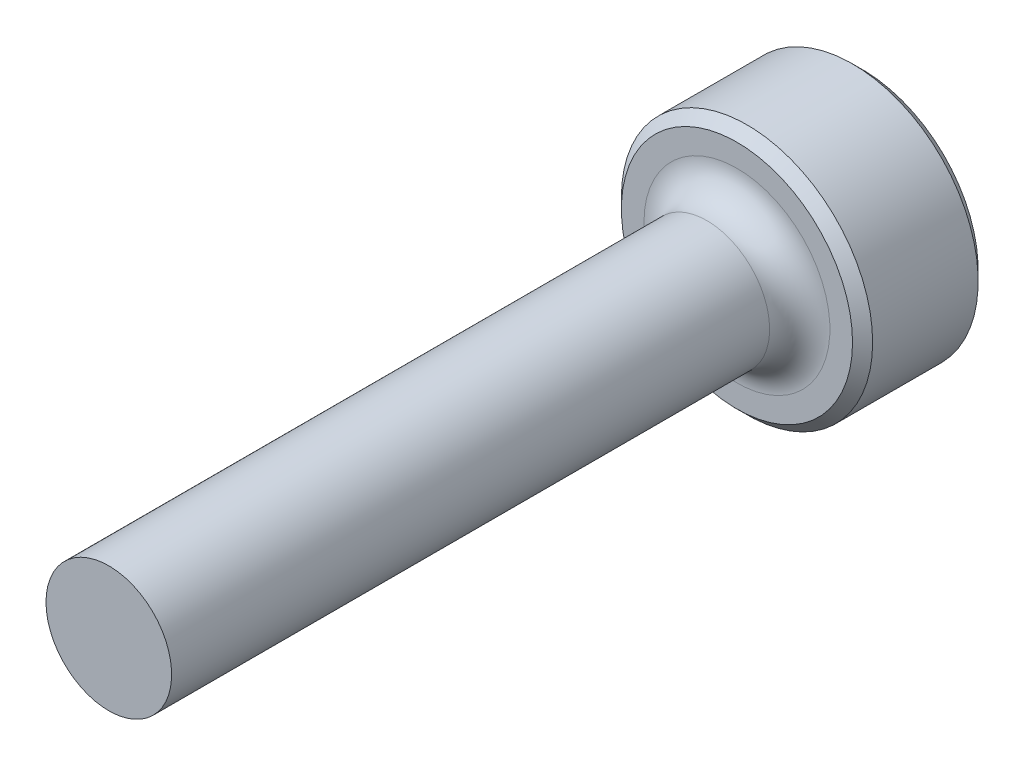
from build123d import *

# Parameters (mm, degrees)
CHAMFER1_SIZE = 0.254


with BuildPart() as part:
    # Sketch1 → Revolve1 (revolve)
    with BuildSketch(Plane(origin=(0, 0, 0), x_dir=(0, 0, -1), z_dir=(1, 0, 0)), mode=Mode.PRIVATE) as revolve1_sk:
        with BuildLine():
            Line((0, 0), (0, 3.175))
            Line((0, 3.175), (-3.175, 3.175))
            Line((-3.175, 3.175), (-3.175, 2.3495))
            ThreePointArc((-3.175, 2.3495), (-3.398184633, 1.810684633), (-3.937, 1.5875))
            Line((-3.937, 1.5875), (-19.05, 1.5875))
            Line((-19.05, 1.5875), (-19.05, 0))
            Line((-19.05, 0), (0, 0))
        make_face()
    revolve(revolve1_sk.sketch.rotate(Axis((0, 0, -25.434744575), (0, 0, 1)), 90), axis=Axis((0, 0, -25.434744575), (0, 0, 1)))

    # Chamfer1
    chamfer1_edges = [part.edges().sort_by_distance(p)[0] for p in [
        (3.175, 0, 0),
        (3.175, 0, 3.175),
    ]]
    chamfer(chamfer1_edges, length=CHAMFER1_SIZE)


solid = part.part
